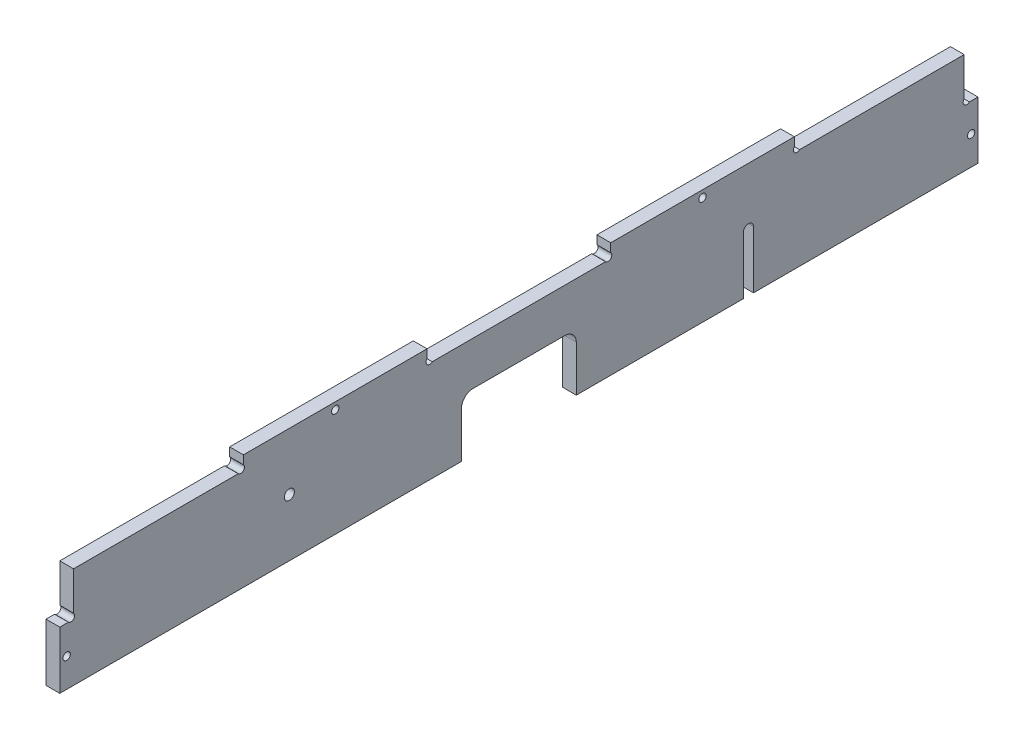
from build123d import *

# Parameters (mm, degrees)
ESQUISSE1_R        = 1.6
ESQUISSE1_R_2      = 2.2
BOSS_EXTRU_1_DEPTH = 6


with BuildPart() as part:
    # Esquisse1 → Boss.-Extru.1 (new body)
    with BuildSketch(Plane(origin=(0, 0, 0), x_dir=(0, 0, -1), z_dir=(1, 0, 0))):
        with BuildLine():
            Line((40, 46.2627417), (40, 50))
            Line((40, 50), (120, 50))
            Line((120, 50), (120, 46.2627417))
            ThreePointArc((120, 46.2627417), (120, 44), (122.2627417, 44))
            Line((122.2627417, 44), (194, 44))
            Line((194, 44), (194, 27.2627417))
            ThreePointArc((194, 27.2627417), (194, 25), (196.2627417, 25))
            Line((196.2627417, 25), (200, 25))
            Line((200, 25), (200, 0))
            Line((200, 0), (102.2, 0))
            Line((102.2, 0), (102.2, 25))
            ThreePointArc((102.2, 25), (100, 27.2), (97.8, 25))
            Line((97.8, 25), (97.8, 0))
            Line((97.8, 0), (25, 0))
            Line((25, 0), (25, 20))
            ThreePointArc((25, 20), (23.535533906, 23.535533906), (20, 25))
            Line((20, 25), (-20, 25))
            ThreePointArc((-20, 25), (-23.535533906, 23.535533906), (-25, 20))
            Line((-25, 20), (-25, 0))
            Line((-25, 0), (-200, 0))
            Line((-200, 0), (-200, 25))
            Line((-200, 25), (-196.2627417, 25))
            ThreePointArc((-196.2627417, 25), (-194, 25), (-194, 27.2627417))
            Line((-194, 27.2627417), (-194, 44))
            Line((-194, 44), (-122.2627417, 44))
            ThreePointArc((-122.2627417, 44), (-120, 44), (-120, 46.2627417))
            Line((-120, 46.2627417), (-120, 50))
            Line((-120, 50), (-40, 50))
            Line((-40, 50), (-40, 46.2627417))
            ThreePointArc((-40, 46.2627417), (-40, 44), (-37.7372583, 44))
            Line((-37.7372583, 44), (37.7372583, 44))
            ThreePointArc((37.7372583, 44), (40, 44), (40, 46.2627417))
        make_face()
        with Locations((80, 47)):
            Circle(ESQUISSE1_R, mode=Mode.SUBTRACT)
        with Locations(Location((-80, 47, 0), (0, 0, 180))):
            Circle(ESQUISSE1_R, mode=Mode.SUBTRACT)
        with Locations((197, 12.5)):
            Circle(ESQUISSE1_R, mode=Mode.SUBTRACT)
        with Locations(Location((-197, 12.5, 0), (0, 0, 180))):
            Circle(ESQUISSE1_R, mode=Mode.SUBTRACT)
        with Locations((-100, 25)):
            Circle(ESQUISSE1_R_2, mode=Mode.SUBTRACT)
    extrude(amount=BOSS_EXTRU_1_DEPTH)


solid = part.part
